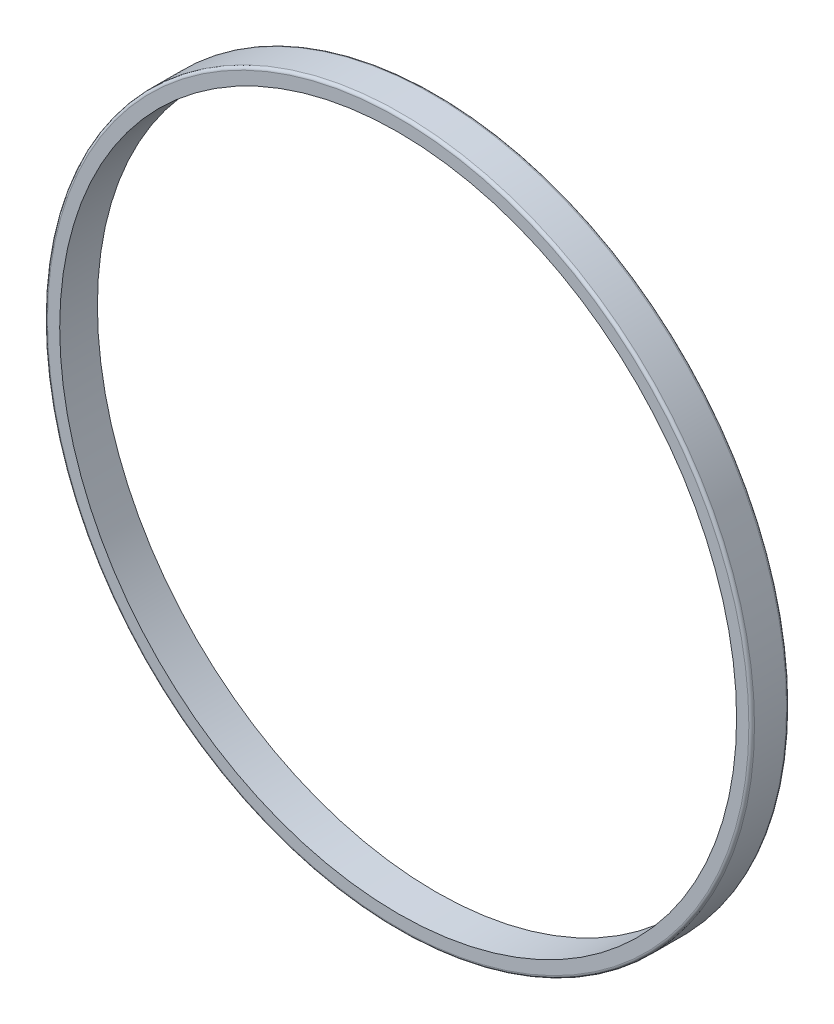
from build123d import *

# Parameters (mm, degrees)
SKETCH_1_R      = 37.5
SKETCH_1_R_2    = 35.9
EXTRUDE_1_DEPTH = 4
FILLET_1_R      = 0.3


with BuildPart() as part:
    # Sketch 1 → Extrude 1 (new body)
    with BuildSketch(Plane.XY):
        Circle(SKETCH_1_R)
        Circle(SKETCH_1_R_2, mode=Mode.SUBTRACT)
    extrude(amount=EXTRUDE_1_DEPTH)

    # Fillet 1
    fillet_1_edges = [part.edges().sort_by_distance(p)[0] for p in [
        (-37.5, 0, 0),
        (-37.5, 0, 4),
    ]]
    fillet(fillet_1_edges, radius=FILLET_1_R)


solid = part.part
